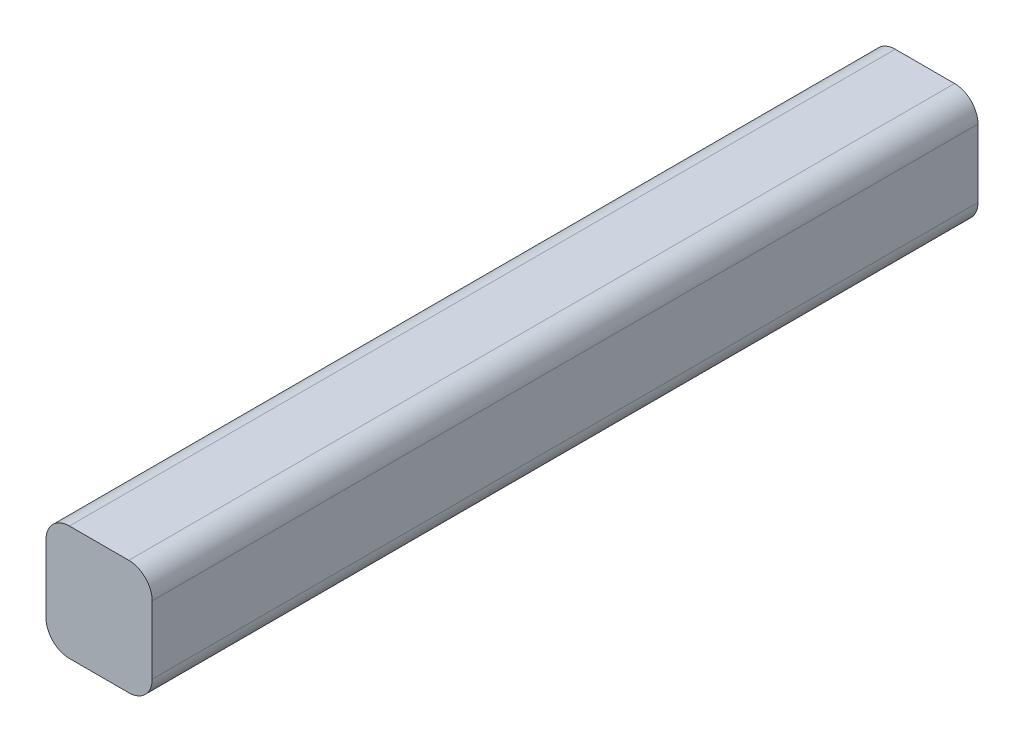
ISO-10303-21;
HEADER;
FILE_DESCRIPTION(('STEP AP214'),'2;1');
FILE_NAME('part.step','',(''),(''),'','','');
FILE_SCHEMA(('AUTOMOTIVE_DESIGN { 1 0 10303 214 1 1 1 1 }'));
ENDSEC;
DATA;
#1=APPLICATION_CONTEXT('core data for automotive mechanical design processes');
#2=APPLICATION_PROTOCOL_DEFINITION('international standard','automotive_design',2000,#1);
#3=PRODUCT_CONTEXT('',#1,'mechanical');
#4=PRODUCT('Part','Part','',(#3));
#5=PRODUCT_RELATED_PRODUCT_CATEGORY('part','',(#4));
#6=PRODUCT_DEFINITION_FORMATION('','',#4);
#7=PRODUCT_DEFINITION_CONTEXT('part definition',#1,'design');
#8=PRODUCT_DEFINITION('design','',#6,#7);
#9=PRODUCT_DEFINITION_SHAPE('','',#8);
#10=(LENGTH_UNIT() NAMED_UNIT(*) SI_UNIT(.MILLI.,.METRE.));
#11=(NAMED_UNIT(*) PLANE_ANGLE_UNIT() SI_UNIT($,.RADIAN.));
#12=(NAMED_UNIT(*) SI_UNIT($,.STERADIAN.) SOLID_ANGLE_UNIT());
#13=UNCERTAINTY_MEASURE_WITH_UNIT(LENGTH_MEASURE(1.E-05),#10,'distance_accuracy_value','');
#14=(GEOMETRIC_REPRESENTATION_CONTEXT(3) GLOBAL_UNCERTAINTY_ASSIGNED_CONTEXT((#13)) GLOBAL_UNIT_ASSIGNED_CONTEXT((#10,
#11,#12)) REPRESENTATION_CONTEXT('',''));
#15=CARTESIAN_POINT('',(0.,0.,0.));
#16=DIRECTION('',(0.,0.,1.));
#17=DIRECTION('',(1.,0.,0.));
#18=AXIS2_PLACEMENT_3D('',#15,#16,#17);
#19=CARTESIAN_POINT('',(-19.39,22.78,328.));
#20=DIRECTION('',(0.,-1.,0.));
#21=DIRECTION('',(0.,0.,-1.));
#22=AXIS2_PLACEMENT_3D('',#19,#20,#21);
#23=PLANE('',#22);
#24=DIRECTION('',(-1.,0.,0.));
#25=VECTOR('',#24,1.);
#26=CARTESIAN_POINT('',(-19.39,22.78,0.));
#27=LINE('',#26,#25);
#28=CARTESIAN_POINT('',(13.48,22.78,0.));
#29=VERTEX_POINT('',#28);
#30=CARTESIAN_POINT('',(-10.09,22.78,0.));
#31=VERTEX_POINT('',#30);
#32=EDGE_CURVE('E146',#29,#31,#27,.T.);
#33=ORIENTED_EDGE('',*,*,#32,.T.);
#34=DIRECTION('',(0.,0.,-1.));
#35=VECTOR('',#34,1.);
#36=CARTESIAN_POINT('',(-10.09,22.78,328.));
#37=LINE('',#36,#35);
#38=CARTESIAN_POINT('',(-10.09,22.78,328.));
#39=VERTEX_POINT('',#38);
#40=EDGE_CURVE('E180',#31,#39,#37,.F.);
#41=ORIENTED_EDGE('',*,*,#40,.T.);
#42=DIRECTION('',(-1.,0.,0.));
#43=VECTOR('',#42,1.);
#44=CARTESIAN_POINT('',(-19.39,22.78,328.));
#45=LINE('',#44,#43);
#46=CARTESIAN_POINT('',(13.48,22.78,328.));
#47=VERTEX_POINT('',#46);
#48=EDGE_CURVE('E144',#47,#39,#45,.T.);
#49=ORIENTED_EDGE('',*,*,#48,.F.);
#50=DIRECTION('',(0.,0.,-1.));
#51=VECTOR('',#50,1.);
#52=CARTESIAN_POINT('',(13.48,22.78,328.));
#53=LINE('',#52,#51);
#54=EDGE_CURVE('E176',#47,#29,#53,.T.);
#55=ORIENTED_EDGE('',*,*,#54,.T.);
#56=EDGE_LOOP('',(#33,#41,#49,#55));
#57=FACE_BOUND('',#56,.T.);
#58=ADVANCED_FACE('F45',(#57),#23,.F.);
#59=CARTESIAN_POINT('',(-19.39,-22.79,328.));
#60=DIRECTION('',(1.,0.,0.));
#61=DIRECTION('',(0.,0.,-1.));
#62=AXIS2_PLACEMENT_3D('',#59,#60,#61);
#63=PLANE('',#62);
#64=DIRECTION('',(0.,-1.,0.));
#65=VECTOR('',#64,1.);
#66=CARTESIAN_POINT('',(-19.39,-22.79,0.));
#67=LINE('',#66,#65);
#68=CARTESIAN_POINT('',(-19.39,13.48,0.));
#69=VERTEX_POINT('',#68);
#70=CARTESIAN_POINT('',(-19.39,-13.49,0.));
#71=VERTEX_POINT('',#70);
#72=EDGE_CURVE('E140',#69,#71,#67,.T.);
#73=ORIENTED_EDGE('',*,*,#72,.T.);
#74=DIRECTION('',(0.,0.,-1.));
#75=VECTOR('',#74,1.);
#76=CARTESIAN_POINT('',(-19.39,-13.49,328.));
#77=LINE('',#76,#75);
#78=CARTESIAN_POINT('',(-19.39,-13.49,328.));
#79=VERTEX_POINT('',#78);
#80=EDGE_CURVE('E116',#71,#79,#77,.F.);
#81=ORIENTED_EDGE('',*,*,#80,.T.);
#82=DIRECTION('',(0.,-1.,0.));
#83=VECTOR('',#82,1.);
#84=CARTESIAN_POINT('',(-19.39,-22.79,328.));
#85=LINE('',#84,#83);
#86=CARTESIAN_POINT('',(-19.39,13.48,328.));
#87=VERTEX_POINT('',#86);
#88=EDGE_CURVE('E199',#87,#79,#85,.T.);
#89=ORIENTED_EDGE('',*,*,#88,.F.);
#90=DIRECTION('',(0.,0.,-1.));
#91=VECTOR('',#90,1.);
#92=CARTESIAN_POINT('',(-19.39,13.48,328.));
#93=LINE('',#92,#91);
#94=EDGE_CURVE('E122',#87,#69,#93,.T.);
#95=ORIENTED_EDGE('',*,*,#94,.T.);
#96=EDGE_LOOP('',(#73,#81,#89,#95));
#97=FACE_BOUND('',#96,.T.);
#98=ADVANCED_FACE('F220',(#97),#63,.F.);
#99=CARTESIAN_POINT('',(22.78,-22.79,328.));
#100=DIRECTION('',(0.,1.,0.));
#101=DIRECTION('',(-1.,0.,0.));
#102=AXIS2_PLACEMENT_3D('',#99,#100,#101);
#103=PLANE('',#102);
#104=DIRECTION('',(1.,0.,0.));
#105=VECTOR('',#104,1.);
#106=CARTESIAN_POINT('',(22.78,-22.79,328.));
#107=LINE('',#106,#105);
#108=CARTESIAN_POINT('',(-10.09,-22.79,328.));
#109=VERTEX_POINT('',#108);
#110=CARTESIAN_POINT('',(13.48,-22.79,328.));
#111=VERTEX_POINT('',#110);
#112=EDGE_CURVE('E131',#109,#111,#107,.T.);
#113=ORIENTED_EDGE('',*,*,#112,.F.);
#114=DIRECTION('',(0.,0.,-1.));
#115=VECTOR('',#114,1.);
#116=CARTESIAN_POINT('',(-10.09,-22.79,328.));
#117=LINE('',#116,#115);
#118=CARTESIAN_POINT('',(-10.09,-22.79,0.));
#119=VERTEX_POINT('',#118);
#120=EDGE_CURVE('E115',#109,#119,#117,.T.);
#121=ORIENTED_EDGE('',*,*,#120,.T.);
#122=DIRECTION('',(1.,0.,0.));
#123=VECTOR('',#122,1.);
#124=CARTESIAN_POINT('',(22.78,-22.79,0.));
#125=LINE('',#124,#123);
#126=CARTESIAN_POINT('',(13.48,-22.79,0.));
#127=VERTEX_POINT('',#126);
#128=EDGE_CURVE('E129',#119,#127,#125,.T.);
#129=ORIENTED_EDGE('',*,*,#128,.T.);
#130=DIRECTION('',(0.,0.,-1.));
#131=VECTOR('',#130,1.);
#132=CARTESIAN_POINT('',(13.48,-22.79,328.));
#133=LINE('',#132,#131);
#134=EDGE_CURVE('E134',#127,#111,#133,.F.);
#135=ORIENTED_EDGE('',*,*,#134,.T.);
#136=EDGE_LOOP('',(#113,#121,#129,#135));
#137=FACE_BOUND('',#136,.T.);
#138=ADVANCED_FACE('F128',(#137),#103,.F.);
#139=CARTESIAN_POINT('',(22.78,22.78,328.));
#140=DIRECTION('',(-1.,0.,0.));
#141=DIRECTION('',(0.,-1.,0.));
#142=AXIS2_PLACEMENT_3D('',#139,#140,#141);
#143=PLANE('',#142);
#144=DIRECTION('',(0.,1.,0.));
#145=VECTOR('',#144,1.);
#146=CARTESIAN_POINT('',(22.78,22.78,0.));
#147=LINE('',#146,#145);
#148=CARTESIAN_POINT('',(22.78,-13.49,0.));
#149=VERTEX_POINT('',#148);
#150=CARTESIAN_POINT('',(22.78,13.48,0.));
#151=VERTEX_POINT('',#150);
#152=EDGE_CURVE('E139',#149,#151,#147,.T.);
#153=ORIENTED_EDGE('',*,*,#152,.T.);
#154=DIRECTION('',(0.,0.,-1.));
#155=VECTOR('',#154,1.);
#156=CARTESIAN_POINT('',(22.78,13.48,328.));
#157=LINE('',#156,#155);
#158=CARTESIAN_POINT('',(22.78,13.48,328.));
#159=VERTEX_POINT('',#158);
#160=EDGE_CURVE('E11',#151,#159,#157,.F.);
#161=ORIENTED_EDGE('',*,*,#160,.T.);
#162=DIRECTION('',(0.,1.,0.));
#163=VECTOR('',#162,1.);
#164=CARTESIAN_POINT('',(22.78,22.78,328.));
#165=LINE('',#164,#163);
#166=CARTESIAN_POINT('',(22.78,-13.49,328.));
#167=VERTEX_POINT('',#166);
#168=EDGE_CURVE('E151',#167,#159,#165,.T.);
#169=ORIENTED_EDGE('',*,*,#168,.F.);
#170=DIRECTION('',(0.,0.,-1.));
#171=VECTOR('',#170,1.);
#172=CARTESIAN_POINT('',(22.78,-13.49,328.));
#173=LINE('',#172,#171);
#174=EDGE_CURVE('E54',#167,#149,#173,.T.);
#175=ORIENTED_EDGE('',*,*,#174,.T.);
#176=EDGE_LOOP('',(#153,#161,#169,#175));
#177=FACE_BOUND('',#176,.T.);
#178=ADVANCED_FACE('F185',(#177),#143,.F.);
#179=CARTESIAN_POINT('',(0.,0.,328.));
#180=DIRECTION('',(0.,0.,-1.));
#181=DIRECTION('',(-1.,0.,0.));
#182=AXIS2_PLACEMENT_3D('',#179,#180,#181);
#183=PLANE('',#182);
#184=ORIENTED_EDGE('',*,*,#88,.T.);
#185=CARTESIAN_POINT('',(-10.09,-13.49,328.));
#186=DIRECTION('',(0.,0.,-1.));
#187=DIRECTION('',(-1.,0.,0.));
#188=AXIS2_PLACEMENT_3D('',#185,#186,#187);
#189=CIRCLE('',#188,9.3);
#190=EDGE_CURVE('E173',#79,#109,#189,.F.);
#191=ORIENTED_EDGE('',*,*,#190,.T.);
#192=ORIENTED_EDGE('',*,*,#112,.T.);
#193=CARTESIAN_POINT('',(13.48,-13.49,328.));
#194=DIRECTION('',(0.,0.,-1.));
#195=DIRECTION('',(-1.,0.,0.));
#196=AXIS2_PLACEMENT_3D('',#193,#194,#195);
#197=CIRCLE('',#196,9.3);
#198=EDGE_CURVE('E66',#111,#167,#197,.F.);
#199=ORIENTED_EDGE('',*,*,#198,.T.);
#200=ORIENTED_EDGE('',*,*,#168,.T.);
#201=CARTESIAN_POINT('',(13.48,13.48,328.));
#202=DIRECTION('',(0.,0.,-1.));
#203=DIRECTION('',(-1.,0.,0.));
#204=AXIS2_PLACEMENT_3D('',#201,#202,#203);
#205=CIRCLE('',#204,9.3);
#206=EDGE_CURVE('E167',#159,#47,#205,.F.);
#207=ORIENTED_EDGE('',*,*,#206,.T.);
#208=ORIENTED_EDGE('',*,*,#48,.T.);
#209=CARTESIAN_POINT('',(-10.09,13.48,328.));
#210=DIRECTION('',(0.,0.,-1.));
#211=DIRECTION('',(-1.,0.,0.));
#212=AXIS2_PLACEMENT_3D('',#209,#210,#211);
#213=CIRCLE('',#212,9.3);
#214=EDGE_CURVE('E170',#39,#87,#213,.F.);
#215=ORIENTED_EDGE('',*,*,#214,.T.);
#216=EDGE_LOOP('',(#184,#191,#192,#199,#200,#207,#208,#215));
#217=FACE_BOUND('',#216,.T.);
#218=ADVANCED_FACE('F209',(#217),#183,.F.);
#219=CARTESIAN_POINT('',(0.,0.,0.));
#220=DIRECTION('',(0.,0.,-1.));
#221=DIRECTION('',(-1.,0.,0.));
#222=AXIS2_PLACEMENT_3D('',#219,#220,#221);
#223=PLANE('',#222);
#224=ORIENTED_EDGE('',*,*,#128,.F.);
#225=CARTESIAN_POINT('',(-10.09,-13.49,0.));
#226=DIRECTION('',(0.,0.,-1.));
#227=DIRECTION('',(-1.,0.,0.));
#228=AXIS2_PLACEMENT_3D('',#225,#226,#227);
#229=CIRCLE('',#228,9.3);
#230=EDGE_CURVE('E111',#119,#71,#229,.T.);
#231=ORIENTED_EDGE('',*,*,#230,.T.);
#232=ORIENTED_EDGE('',*,*,#72,.F.);
#233=CARTESIAN_POINT('',(-10.09,13.48,0.));
#234=DIRECTION('',(0.,0.,-1.));
#235=DIRECTION('',(-1.,0.,0.));
#236=AXIS2_PLACEMENT_3D('',#233,#234,#235);
#237=CIRCLE('',#236,9.3);
#238=EDGE_CURVE('E123',#69,#31,#237,.T.);
#239=ORIENTED_EDGE('',*,*,#238,.T.);
#240=ORIENTED_EDGE('',*,*,#32,.F.);
#241=CARTESIAN_POINT('',(13.48,13.48,0.));
#242=DIRECTION('',(0.,0.,-1.));
#243=DIRECTION('',(-1.,0.,0.));
#244=AXIS2_PLACEMENT_3D('',#241,#242,#243);
#245=CIRCLE('',#244,9.3);
#246=EDGE_CURVE('E155',#29,#151,#245,.T.);
#247=ORIENTED_EDGE('',*,*,#246,.T.);
#248=ORIENTED_EDGE('',*,*,#152,.F.);
#249=CARTESIAN_POINT('',(13.48,-13.49,0.));
#250=DIRECTION('',(0.,0.,-1.));
#251=DIRECTION('',(-1.,0.,0.));
#252=AXIS2_PLACEMENT_3D('',#249,#250,#251);
#253=CIRCLE('',#252,9.3);
#254=EDGE_CURVE('E133',#149,#127,#253,.T.);
#255=ORIENTED_EDGE('',*,*,#254,.T.);
#256=EDGE_LOOP('',(#224,#231,#232,#239,#240,#247,#248,#255));
#257=FACE_BOUND('',#256,.T.);
#258=ADVANCED_FACE('F136',(#257),#223,.T.);
#259=CARTESIAN_POINT('',(-10.09,-13.49,328.));
#260=DIRECTION('',(0.,0.,-1.));
#261=DIRECTION('',(-1.,0.,0.));
#262=AXIS2_PLACEMENT_3D('',#259,#260,#261);
#263=CYLINDRICAL_SURFACE('',#262,9.3);
#264=ORIENTED_EDGE('',*,*,#190,.F.);
#265=ORIENTED_EDGE('',*,*,#80,.F.);
#266=ORIENTED_EDGE('',*,*,#230,.F.);
#267=ORIENTED_EDGE('',*,*,#120,.F.);
#268=EDGE_LOOP('',(#264,#265,#266,#267));
#269=FACE_BOUND('',#268,.T.);
#270=ADVANCED_FACE('F114',(#269),#263,.T.);
#271=CARTESIAN_POINT('',(-10.09,13.48,328.));
#272=DIRECTION('',(0.,0.,-1.));
#273=DIRECTION('',(-1.,0.,0.));
#274=AXIS2_PLACEMENT_3D('',#271,#272,#273);
#275=CYLINDRICAL_SURFACE('',#274,9.3);
#276=ORIENTED_EDGE('',*,*,#214,.F.);
#277=ORIENTED_EDGE('',*,*,#40,.F.);
#278=ORIENTED_EDGE('',*,*,#238,.F.);
#279=ORIENTED_EDGE('',*,*,#94,.F.);
#280=EDGE_LOOP('',(#276,#277,#278,#279));
#281=FACE_BOUND('',#280,.T.);
#282=ADVANCED_FACE('F231',(#281),#275,.T.);
#283=CARTESIAN_POINT('',(13.48,13.48,328.));
#284=DIRECTION('',(0.,0.,-1.));
#285=DIRECTION('',(-1.,0.,0.));
#286=AXIS2_PLACEMENT_3D('',#283,#284,#285);
#287=CYLINDRICAL_SURFACE('',#286,9.3);
#288=ORIENTED_EDGE('',*,*,#206,.F.);
#289=ORIENTED_EDGE('',*,*,#160,.F.);
#290=ORIENTED_EDGE('',*,*,#246,.F.);
#291=ORIENTED_EDGE('',*,*,#54,.F.);
#292=EDGE_LOOP('',(#288,#289,#290,#291));
#293=FACE_BOUND('',#292,.T.);
#294=ADVANCED_FACE('F192',(#293),#287,.T.);
#295=CARTESIAN_POINT('',(13.48,-13.49,328.));
#296=DIRECTION('',(0.,0.,-1.));
#297=DIRECTION('',(-1.,0.,0.));
#298=AXIS2_PLACEMENT_3D('',#295,#296,#297);
#299=CYLINDRICAL_SURFACE('',#298,9.3);
#300=ORIENTED_EDGE('',*,*,#198,.F.);
#301=ORIENTED_EDGE('',*,*,#134,.F.);
#302=ORIENTED_EDGE('',*,*,#254,.F.);
#303=ORIENTED_EDGE('',*,*,#174,.F.);
#304=EDGE_LOOP('',(#300,#301,#302,#303));
#305=FACE_BOUND('',#304,.T.);
#306=ADVANCED_FACE('F47',(#305),#299,.T.);
#307=CLOSED_SHELL('',(#58,#98,#138,#178,#218,#258,#270,#282,#294,#306));
#308=MANIFOLD_SOLID_BREP('B2',#307);
#309=ADVANCED_BREP_SHAPE_REPRESENTATION('',(#18,#308),#14);
#310=SHAPE_DEFINITION_REPRESENTATION(#9,#309);
ENDSEC;
END-ISO-10303-21;
